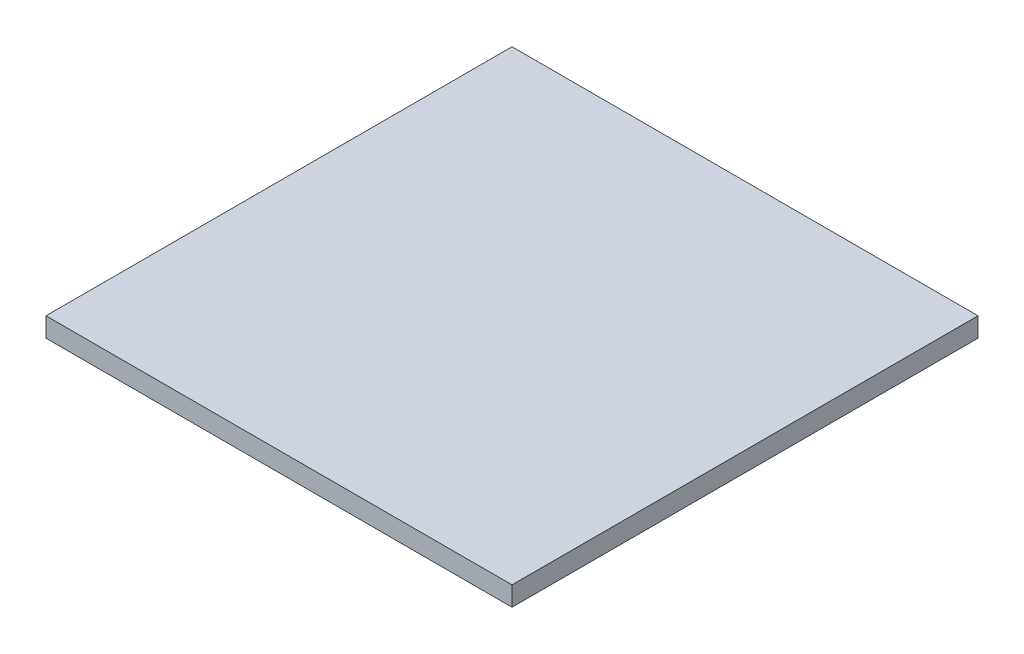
from build123d import *

# Parameters (mm, degrees)
SKETCH1_W           = 3657.6
SKETCH1_H           = 3657.6
BOSS_EXTRUDE1_DEPTH = 152.4


with BuildPart() as part:
    # Sketch1 → Boss-Extrude1 (new body)
    with BuildSketch(Plane(origin=(0, 0, 0), x_dir=(1, 0, 0), z_dir=(0, 1, 0))):
        Rectangle(SKETCH1_W, SKETCH1_H)
    extrude(amount=BOSS_EXTRUDE1_DEPTH)


solid = part.part
